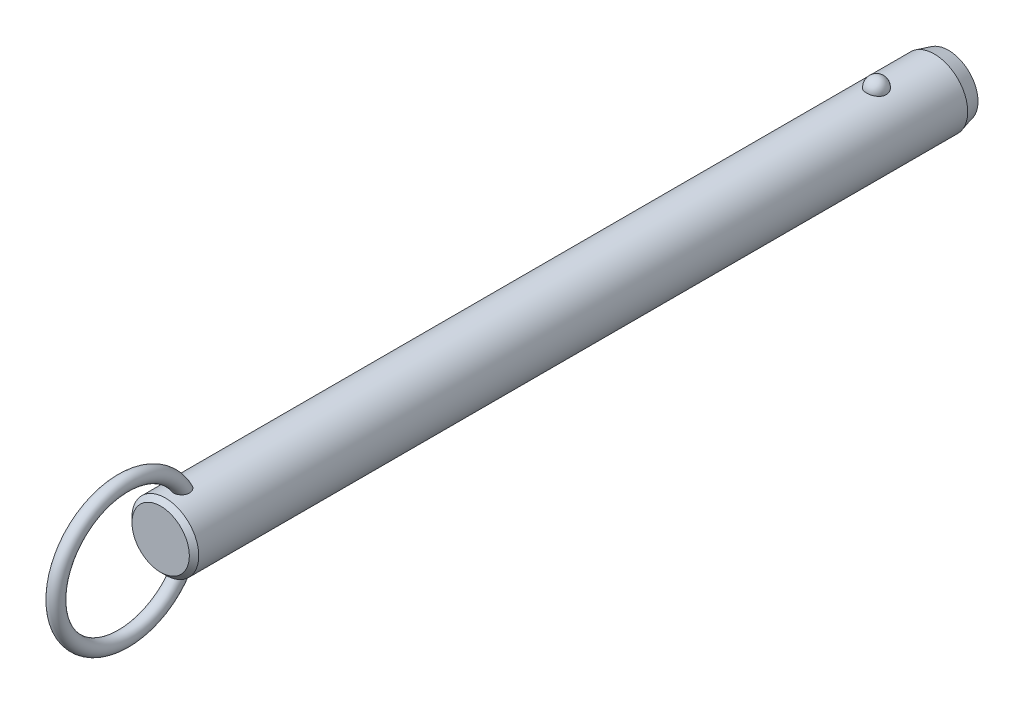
ISO-10303-21;
HEADER;
FILE_DESCRIPTION(('STEP AP214'),'2;1');
FILE_NAME('part.step','',(''),(''),'','','');
FILE_SCHEMA(('AUTOMOTIVE_DESIGN { 1 0 10303 214 1 1 1 1 }'));
ENDSEC;
DATA;
#1=APPLICATION_CONTEXT('core data for automotive mechanical design processes');
#2=APPLICATION_PROTOCOL_DEFINITION('international standard','automotive_design',2000,#1);
#3=PRODUCT_CONTEXT('',#1,'mechanical');
#4=PRODUCT('Part','Part','',(#3));
#5=PRODUCT_RELATED_PRODUCT_CATEGORY('part','',(#4));
#6=PRODUCT_DEFINITION_FORMATION('','',#4);
#7=PRODUCT_DEFINITION_CONTEXT('part definition',#1,'design');
#8=PRODUCT_DEFINITION('design','',#6,#7);
#9=PRODUCT_DEFINITION_SHAPE('','',#8);
#10=(LENGTH_UNIT() NAMED_UNIT(*) SI_UNIT(.MILLI.,.METRE.));
#11=(NAMED_UNIT(*) PLANE_ANGLE_UNIT() SI_UNIT($,.RADIAN.));
#12=(NAMED_UNIT(*) SI_UNIT($,.STERADIAN.) SOLID_ANGLE_UNIT());
#13=UNCERTAINTY_MEASURE_WITH_UNIT(LENGTH_MEASURE(1.E-05),#10,'distance_accuracy_value','');
#14=(GEOMETRIC_REPRESENTATION_CONTEXT(3) GLOBAL_UNCERTAINTY_ASSIGNED_CONTEXT((#13)) GLOBAL_UNIT_ASSIGNED_CONTEXT((#10,
#11,#12)) REPRESENTATION_CONTEXT('',''));
#15=CARTESIAN_POINT('',(0.,0.,0.));
#16=DIRECTION('',(0.,0.,1.));
#17=DIRECTION('',(1.,0.,0.));
#18=AXIS2_PLACEMENT_3D('',#15,#16,#17);
#19=CARTESIAN_POINT('',(0.,0.,142.2));
#20=DIRECTION('',(0.,0.,-1.));
#21=DIRECTION('',(-1.,0.,0.));
#22=AXIS2_PLACEMENT_3D('',#19,#20,#21);
#23=CYLINDRICAL_SURFACE('',#22,7.1);
#24=CARTESIAN_POINT('',(2.0769088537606,6.78943661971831,-2.1));
#25=CARTESIAN_POINT('',(2.07690739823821,6.78943796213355,-1.98268154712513));
#26=CARTESIAN_POINT('',(2.06738130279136,6.79237331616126,-1.86534506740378));
#27=CARTESIAN_POINT('',(2.0295040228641,6.8037853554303,-1.63400788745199));
#28=CARTESIAN_POINT('',(2.00114757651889,6.81226358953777,-1.52000812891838));
#29=CARTESIAN_POINT('',(1.92632025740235,6.83379798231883,-1.29863433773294));
#30=CARTESIAN_POINT('',(1.87985726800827,6.84685214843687,-1.19125744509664));
#31=CARTESIAN_POINT('',(1.76995205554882,6.87608091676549,-0.98604657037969));
#32=CARTESIAN_POINT('',(1.70650980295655,6.8922555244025,-0.88821260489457));
#33=CARTESIAN_POINT('',(1.5638119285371,6.92602930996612,-0.704242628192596));
#34=CARTESIAN_POINT('',(1.4844714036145,6.94363582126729,-0.618173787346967));
#35=CARTESIAN_POINT('',(1.31221746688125,6.97823658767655,-0.460740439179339));
#36=CARTESIAN_POINT('',(1.21930409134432,6.99523084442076,-0.389375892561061));
#37=CARTESIAN_POINT('',(1.02268781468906,7.02666176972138,-0.263547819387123));
#38=CARTESIAN_POINT('',(0.91902009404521,7.04110638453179,-0.209031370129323));
#39=CARTESIAN_POINT('',(0.703548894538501,7.06588726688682,-0.118163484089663));
#40=CARTESIAN_POINT('',(0.591746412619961,7.07622403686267,-0.0818098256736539));
#41=CARTESIAN_POINT('',(0.365557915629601,7.09147068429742,-0.0288711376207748));
#42=CARTESIAN_POINT('',(0.251267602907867,7.09648447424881,-0.0119070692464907));
#43=CARTESIAN_POINT('',(0.0213499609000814,7.10089837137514,0.00304925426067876));
#44=CARTESIAN_POINT('',(-0.0942772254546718,7.10029907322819,0.00104351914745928));
#45=CARTESIAN_POINT('',(-0.321651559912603,7.09360829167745,-0.0216931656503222));
#46=CARTESIAN_POINT('',(-0.433431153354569,7.08760388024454,-0.0421272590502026));
#47=CARTESIAN_POINT('',(-0.651862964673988,7.07086131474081,-0.100729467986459));
#48=CARTESIAN_POINT('',(-0.758515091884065,7.06012307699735,-0.138897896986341));
#49=CARTESIAN_POINT('',(-0.964449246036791,7.03496097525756,-0.232213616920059));
#50=CARTESIAN_POINT('',(-1.06368095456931,7.02051445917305,-0.287465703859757));
#51=CARTESIAN_POINT('',(-1.25145353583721,6.98948740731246,-0.413383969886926));
#52=CARTESIAN_POINT('',(-1.33999321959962,6.97290663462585,-0.48405186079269));
#53=CARTESIAN_POINT('',(-1.50591604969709,6.93898770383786,-0.640594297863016));
#54=CARTESIAN_POINT('',(-1.58302488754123,6.92164094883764,-0.726757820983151));
#55=CARTESIAN_POINT('',(-1.72189320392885,6.8884103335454,-0.91092752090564));
#56=CARTESIAN_POINT('',(-1.78365144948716,6.87252659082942,-1.008934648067));
#57=CARTESIAN_POINT('',(-1.89101272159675,6.84377189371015,-1.21549497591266));
#58=CARTESIAN_POINT('',(-1.93639553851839,6.83094274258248,-1.32416860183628));
#59=CARTESIAN_POINT('',(-2.00874275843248,6.81002070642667,-1.54791500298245));
#60=CARTESIAN_POINT('',(-2.03570774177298,6.80192767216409,-1.66298757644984));
#61=CARTESIAN_POINT('',(-2.07047276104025,6.7914266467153,-1.89571453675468));
#62=CARTESIAN_POINT('',(-2.07835878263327,6.78899315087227,-2.01335491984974));
#63=CARTESIAN_POINT('',(-2.07502083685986,6.79001409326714,-2.24833570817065));
#64=CARTESIAN_POINT('',(-2.06379746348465,6.7934683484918,-2.36567612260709));
#65=CARTESIAN_POINT('',(-2.02263913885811,6.80583442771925,-2.59603194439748));
#66=CARTESIAN_POINT('',(-1.99281127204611,6.81471501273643,-2.70906820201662));
#67=CARTESIAN_POINT('',(-1.91526639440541,6.83691232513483,-2.92836575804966));
#68=CARTESIAN_POINT('',(-1.8675486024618,6.85022924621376,-3.03462676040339));
#69=CARTESIAN_POINT('',(-1.75504492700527,6.87991336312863,-3.23806487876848));
#70=CARTESIAN_POINT('',(-1.69015924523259,6.89629822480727,-3.33518422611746));
#71=CARTESIAN_POINT('',(-1.54505404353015,6.93024852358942,-3.51697105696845));
#72=CARTESIAN_POINT('',(-1.46483385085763,6.94781401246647,-3.60163799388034));
#73=CARTESIAN_POINT('',(-1.29071406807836,6.98225977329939,-3.75654119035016));
#74=CARTESIAN_POINT('',(-1.19675650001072,6.99913673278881,-3.82671308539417));
#75=CARTESIAN_POINT('',(-0.997940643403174,7.03023618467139,-3.9501837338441));
#76=CARTESIAN_POINT('',(-0.89308318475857,7.04445887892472,-4.00348377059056));
#77=CARTESIAN_POINT('',(-0.676902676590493,7.06848365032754,-4.09107242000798));
#78=CARTESIAN_POINT('',(-0.565686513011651,7.0783430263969,-4.12560889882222));
#79=CARTESIAN_POINT('',(-0.338739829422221,7.09282534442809,-4.17575450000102));
#80=CARTESIAN_POINT('',(-0.223009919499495,7.09744899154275,-4.19136617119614));
#81=CARTESIAN_POINT('',(0.00707628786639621,7.10090930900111,-4.20307965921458));
#82=CARTESIAN_POINT('',(0.121410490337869,7.09986531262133,-4.19958377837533));
#83=CARTESIAN_POINT('',(0.347815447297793,7.092380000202,-4.17411564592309));
#84=CARTESIAN_POINT('',(0.459886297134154,7.08593891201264,-4.15214417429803));
#85=CARTESIAN_POINT('',(0.678084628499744,7.06838983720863,-4.09049562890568));
#86=CARTESIAN_POINT('',(0.784237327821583,7.05730369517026,-4.05090137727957));
#87=CARTESIAN_POINT('',(0.988305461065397,7.03163139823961,-3.95511447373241));
#88=CARTESIAN_POINT('',(1.08622031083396,7.01704499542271,-3.89892064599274));
#89=CARTESIAN_POINT('',(1.27284490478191,6.98562668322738,-3.77035541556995));
#90=CARTESIAN_POINT('',(1.36137372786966,6.96876135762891,-3.69772964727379));
#91=CARTESIAN_POINT('',(1.52509486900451,6.93477412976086,-3.53878279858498));
#92=CARTESIAN_POINT('',(1.60028496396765,6.91765218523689,-3.45245943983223));
#93=CARTESIAN_POINT('',(1.73681688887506,6.88465753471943,-3.26658774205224));
#94=CARTESIAN_POINT('',(1.79785966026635,6.86881574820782,-3.16681408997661));
#95=CARTESIAN_POINT('',(1.90265327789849,6.84053157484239,-2.95814408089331));
#96=CARTESIAN_POINT('',(1.94640861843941,6.82808830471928,-2.84925010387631));
#97=CARTESIAN_POINT('',(2.01274378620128,6.80881460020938,-2.63454318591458));
#98=CARTESIAN_POINT('',(2.03676193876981,6.80160856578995,-2.52920574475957));
#99=CARTESIAN_POINT('',(2.06884490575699,6.79191902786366,-2.3159172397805));
#100=CARTESIAN_POINT('',(2.07691019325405,6.78943538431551,-2.20796625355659));
#101=CARTESIAN_POINT('',(2.0769088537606,6.78943661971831,-2.1));
#102=B_SPLINE_CURVE_WITH_KNOTS('',3,(#24,#25,#26,#27,#28,#29,#30,#31,#32,#33,#34,#35,#36,#37,
#38,#39,#40,#41,#42,#43,#44,#45,#46,#47,#48,#49,#50,#51,#52,#53,#54,#55,#56,#57,#58,#59,#60,#61,
#62,#63,#64,#65,#66,#67,#68,#69,#70,#71,#72,#73,#74,#75,#76,#77,#78,#79,#80,#81,#82,#83,#84,#85,
#86,#87,#88,#89,#90,#91,#92,#93,#94,#95,#96,#97,#98,#99,#100,#101),.UNSPECIFIED.,.T.,.F.,(4,2,2,
2,2,2,2,2,2,2,2,2,2,2,2,2,2,2,2,2,2,2,2,2,2,2,2,2,2,2,2,2,2,2,2,2,2,2,4),(0.,0.351568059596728,
0.703234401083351,1.05474780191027,1.40626181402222,1.75970563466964,2.11314851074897,
2.4654696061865,2.81774759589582,3.16301449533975,3.50824481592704,3.84801136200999,
4.18778391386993,4.52968352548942,4.87162112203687,5.22076181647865,5.56993054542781,
5.92363364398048,6.27732559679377,6.62942052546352,6.98150450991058,7.33158042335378,
7.68167162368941,8.03384443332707,8.38603269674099,8.73975272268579,9.09344583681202,
9.44234545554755,9.79119807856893,10.1327344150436,10.4742563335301,10.8141898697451,
11.1541474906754,11.4997793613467,11.8454687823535,12.1979079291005,12.5502553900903,
12.8738073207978,13.1973496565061),.UNSPECIFIED.);
#103=CARTESIAN_POINT('',(2.0769088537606,6.78943661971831,-2.1));
#104=VERTEX_POINT('',#103);
#105=EDGE_CURVE('E41',#104,#104,#102,.T.);
#106=ORIENTED_EDGE('',*,*,#105,.T.);
#107=EDGE_LOOP('',(#106));
#108=FACE_BOUND('',#107,.T.);
#109=CARTESIAN_POINT('',(0.,0.,149.12));
#110=DIRECTION('',(0.,0.,1.));
#111=DIRECTION('',(1.,0.,0.));
#112=AXIS2_PLACEMENT_3D('',#109,#110,#111);
#113=CIRCLE('',#112,7.1);
#114=CARTESIAN_POINT('',(7.1,0.,149.12));
#115=VERTEX_POINT('',#114);
#116=EDGE_CURVE('E10',#115,#115,#113,.F.);
#117=ORIENTED_EDGE('',*,*,#116,.T.);
#118=EDGE_LOOP('',(#117));
#119=FACE_BOUND('',#118,.T.);
#120=CARTESIAN_POINT('',(-0.429539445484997,-7.08699541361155,143.942921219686));
#121=CARTESIAN_POINT('',(-0.508331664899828,-7.08221999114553,143.966876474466));
#122=CARTESIAN_POINT('',(-0.585039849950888,-7.07624016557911,143.997457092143));
#123=CARTESIAN_POINT('',(-0.73208265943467,-7.06254296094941,144.071024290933));
#124=CARTESIAN_POINT('',(-0.802417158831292,-7.05482554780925,144.114011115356));
#125=CARTESIAN_POINT('',(-0.934722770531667,-7.03851844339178,144.211113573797));
#126=CARTESIAN_POINT('',(-0.996700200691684,-7.02992941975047,144.265220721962));
#127=CARTESIAN_POINT('',(-1.11079942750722,-7.01280697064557,144.382967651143));
#128=CARTESIAN_POINT('',(-1.16292136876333,-7.00427354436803,144.446607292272));
#129=CARTESIAN_POINT('',(-1.25705660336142,-6.98799959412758,144.582687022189));
#130=CARTESIAN_POINT('',(-1.29888032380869,-6.98027525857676,144.655259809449));
#131=CARTESIAN_POINT('',(-1.37069920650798,-6.96652886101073,144.806168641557));
#132=CARTESIAN_POINT('',(-1.40069157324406,-6.96050720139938,144.884506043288));
#133=CARTESIAN_POINT('',(-1.45043507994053,-6.95031881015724,145.050190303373));
#134=CARTESIAN_POINT('',(-1.46937115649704,-6.94630231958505,145.137789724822));
#135=CARTESIAN_POINT('',(-1.49424917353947,-6.94099239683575,145.314871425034));
#136=CARTESIAN_POINT('',(-1.50018601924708,-6.93970003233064,145.404354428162));
#137=CARTESIAN_POINT('',(-1.49978214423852,-6.93978815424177,145.594060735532));
#138=CARTESIAN_POINT('',(-1.49187639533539,-6.94150934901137,145.694279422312));
#139=CARTESIAN_POINT('',(-1.46177925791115,-6.94790814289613,145.892479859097));
#140=CARTESIAN_POINT('',(-1.43957541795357,-6.95258831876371,145.990459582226));
#141=CARTESIAN_POINT('',(-1.37783293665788,-6.96510647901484,146.19536292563));
#142=CARTESIAN_POINT('',(-1.33634073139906,-6.97328848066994,146.301680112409));
#143=CARTESIAN_POINT('',(-1.23686994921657,-6.99161706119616,146.506177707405));
#144=CARTESIAN_POINT('',(-1.17889192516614,-7.00176357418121,146.604358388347));
#145=CARTESIAN_POINT('',(-1.0587512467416,-7.02082898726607,146.772374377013));
#146=CARTESIAN_POINT('',(-0.999247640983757,-7.02963746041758,146.844123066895));
#147=CARTESIAN_POINT('',(-0.869494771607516,-7.04686074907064,146.977195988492));
#148=CARTESIAN_POINT('',(-0.799263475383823,-7.05527619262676,147.038537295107));
#149=CARTESIAN_POINT('',(-0.665408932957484,-7.06899457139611,147.135131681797));
#150=CARTESIAN_POINT('',(-0.603817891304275,-7.07457275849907,147.173151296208));
#151=CARTESIAN_POINT('',(-0.475172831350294,-7.08437420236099,147.238758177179));
#152=CARTESIAN_POINT('',(-0.408123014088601,-7.08859848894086,147.266353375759));
#153=CARTESIAN_POINT('',(-0.269431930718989,-7.09522749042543,147.309256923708));
#154=CARTESIAN_POINT('',(-0.197757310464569,-7.09761688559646,147.324461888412));
#155=CARTESIAN_POINT('',(-0.0527849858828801,-7.10017268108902,147.340716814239));
#156=CARTESIAN_POINT('',(0.020511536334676,-7.10034065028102,147.341776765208));
#157=CARTESIAN_POINT('',(0.156426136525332,-7.09855986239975,147.330461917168));
#158=CARTESIAN_POINT('',(0.219199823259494,-7.09688191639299,147.319806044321));
#159=CARTESIAN_POINT('',(0.342134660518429,-7.09201880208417,147.288537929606));
#160=CARTESIAN_POINT('',(0.402295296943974,-7.08883333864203,147.267923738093));
#161=CARTESIAN_POINT('',(0.520687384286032,-7.08113868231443,147.217212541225));
#162=CARTESIAN_POINT('',(0.578791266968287,-7.07658958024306,147.186827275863));
#163=CARTESIAN_POINT('',(0.69017323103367,-7.06659708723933,147.118367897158));
#164=CARTESIAN_POINT('',(0.743447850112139,-7.061153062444,147.080288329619));
#165=CARTESIAN_POINT('',(0.87094790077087,-7.04680292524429,146.976592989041));
#166=CARTESIAN_POINT('',(0.941828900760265,-7.03755800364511,146.906897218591));
#167=CARTESIAN_POINT('',(1.07136606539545,-7.01900793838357,146.756945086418));
#168=CARTESIAN_POINT('',(1.13000013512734,-7.00970271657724,146.676670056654));
#169=CARTESIAN_POINT('',(1.23579584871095,-6.99183327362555,146.506899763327));
#170=CARTESIAN_POINT('',(1.28274271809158,-6.98328455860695,146.417269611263));
#171=CARTESIAN_POINT('',(1.3635144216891,-6.96796352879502,146.232176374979));
#172=CARTESIAN_POINT('',(1.39733971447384,-6.96119115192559,146.136713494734));
#173=CARTESIAN_POINT('',(1.45579181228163,-6.94922464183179,145.92530928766));
#174=CARTESIAN_POINT('',(1.47790145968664,-6.94449000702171,145.808631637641));
#175=CARTESIAN_POINT('',(1.50168752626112,-6.93938731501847,145.573015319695));
#176=CARTESIAN_POINT('',(1.50336085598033,-6.93901991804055,145.45407631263));
#177=CARTESIAN_POINT('',(1.48486516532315,-6.9430010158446,145.22360799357));
#178=CARTESIAN_POINT('',(1.46573441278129,-6.9471253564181,145.111995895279));
#179=CARTESIAN_POINT('',(1.40606892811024,-6.95944667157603,144.894886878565));
#180=CARTESIAN_POINT('',(1.36556446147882,-6.96763788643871,144.7893815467));
#181=CARTESIAN_POINT('',(1.2708270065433,-6.98548038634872,144.604287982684));
#182=CARTESIAN_POINT('',(1.21949810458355,-6.99473841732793,144.523171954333));
#183=CARTESIAN_POINT('',(1.10242050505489,-7.0141406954,144.372227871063));
#184=CARTESIAN_POINT('',(1.03668119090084,-7.02428436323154,144.30239252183));
#185=CARTESIAN_POINT('',(0.900559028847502,-7.04295285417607,144.183573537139));
#186=CARTESIAN_POINT('',(0.831428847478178,-7.05153466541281,144.133157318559));
#187=CARTESIAN_POINT('',(0.685291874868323,-7.06723150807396,144.045142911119));
#188=CARTESIAN_POINT('',(0.608287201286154,-7.07434693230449,144.007541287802));
#189=CARTESIAN_POINT('',(0.451878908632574,-7.08602232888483,143.947491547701));
#190=CARTESIAN_POINT('',(0.372686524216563,-7.09067127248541,143.924508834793));
#191=CARTESIAN_POINT('',(0.211477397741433,-7.09730788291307,143.892035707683));
#192=CARTESIAN_POINT('',(0.129460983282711,-7.09929585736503,143.88254373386));
#193=CARTESIAN_POINT('',(-0.0332905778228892,-7.10037858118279,143.877351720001));
#194=CARTESIAN_POINT('',(-0.114016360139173,-7.09953334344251,143.881365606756));
#195=CARTESIAN_POINT('',(-0.27367033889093,-7.09517338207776,143.902454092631));
#196=CARTESIAN_POINT('',(-0.352598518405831,-7.09165863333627,143.919528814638));
#197=CARTESIAN_POINT('',(-0.429539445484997,-7.08699541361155,143.942921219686));
#198=B_SPLINE_CURVE_WITH_KNOTS('',3,(#120,#121,#122,#123,#124,#125,#126,#127,#128,#129,#130,
#131,#132,#133,#134,#135,#136,#137,#138,#139,#140,#141,#142,#143,#144,#145,#146,#147,#148,#149,
#150,#151,#152,#153,#154,#155,#156,#157,#158,#159,#160,#161,#162,#163,#164,#165,#166,#167,#168,
#169,#170,#171,#172,#173,#174,#175,#176,#177,#178,#179,#180,#181,#182,#183,#184,#185,#186,#187,
#188,#189,#190,#191,#192,#193,#194,#195,#196,#197),.UNSPECIFIED.,.T.,.F.,(4,2,2,2,2,2,2,2,2,2,2,
2,2,2,2,2,2,2,2,2,2,2,2,2,2,2,2,2,2,2,2,2,2,2,2,2,2,2,4),(0.,0.247183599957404,
0.494372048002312,0.741372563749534,0.988369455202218,1.23962059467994,1.490931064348,
1.75897818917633,2.02713035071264,2.3275826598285,2.62829697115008,2.97008736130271,
3.31186629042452,3.59175319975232,3.87117637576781,4.08813841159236,4.30493502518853,
4.5235225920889,4.74195577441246,4.93215328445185,5.12238804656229,5.318848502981,
5.51544871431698,5.81332317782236,6.11173048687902,6.41527266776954,6.71880423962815,
7.07358156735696,7.42841252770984,7.76631485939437,8.10373999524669,8.39142246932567,
8.67891817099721,8.93560332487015,9.19221962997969,9.43881106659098,9.68537399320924,
9.92674752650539,10.1681233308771),.UNSPECIFIED.);
#199=CARTESIAN_POINT('',(-0.429539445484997,-7.08699541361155,143.942921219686));
#200=VERTEX_POINT('',#199);
#201=EDGE_CURVE('E59',#200,#200,#198,.T.);
#202=ORIENTED_EDGE('',*,*,#201,.T.);
#203=EDGE_LOOP('',(#202));
#204=FACE_BOUND('',#203,.T.);
#205=CARTESIAN_POINT('',(-0.429539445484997,7.08699541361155,143.942921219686));
#206=CARTESIAN_POINT('',(-0.351665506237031,7.09171429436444,143.919246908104));
#207=CARTESIAN_POINT('',(-0.271733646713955,7.09525896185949,143.902036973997));
#208=CARTESIAN_POINT('',(-0.110026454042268,7.09960839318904,143.881005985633));
#209=CARTESIAN_POINT('',(-0.0282502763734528,7.10041187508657,143.877191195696));
#210=CARTESIAN_POINT('',(0.134782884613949,7.09918849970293,143.883059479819));
#211=CARTESIAN_POINT('',(0.216039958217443,7.09716214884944,143.89274013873));
#212=CARTESIAN_POINT('',(0.375730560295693,7.09050177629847,143.925347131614));
#213=CARTESIAN_POINT('',(0.454164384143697,7.08586802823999,143.948272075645));
#214=CARTESIAN_POINT('',(0.606025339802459,7.07449911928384,144.006771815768));
#215=CARTESIAN_POINT('',(0.679451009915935,7.06776334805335,144.042350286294));
#216=CARTESIAN_POINT('',(0.81923414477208,7.05292866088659,144.125175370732));
#217=CARTESIAN_POINT('',(0.885591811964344,7.04482978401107,144.172421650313));
#218=CARTESIAN_POINT('',(1.00993211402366,7.02808709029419,144.277590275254));
#219=CARTESIAN_POINT('',(1.06785399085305,7.01943990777,144.335583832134));
#220=CARTESIAN_POINT('',(1.17342527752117,7.00256662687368,144.460301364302));
#221=CARTESIAN_POINT('',(1.22107408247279,6.99434055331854,144.527025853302));
#222=CARTESIAN_POINT('',(1.30652927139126,6.97889183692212,144.669362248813));
#223=CARTESIAN_POINT('',(1.34399711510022,6.97170674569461,144.745180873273));
#224=CARTESIAN_POINT('',(1.40682616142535,6.95930080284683,144.901810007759));
#225=CARTESIAN_POINT('',(1.43218374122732,6.95408053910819,144.98262200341));
#226=CARTESIAN_POINT('',(1.47246409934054,6.94566853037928,145.153531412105));
#227=CARTESIAN_POINT('',(1.48642590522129,6.9426653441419,145.24386307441));
#228=CARTESIAN_POINT('',(1.5011410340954,6.93949744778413,145.425619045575));
#229=CARTESIAN_POINT('',(1.50188917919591,6.93933385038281,145.517043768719));
#230=CARTESIAN_POINT('',(1.49030464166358,6.94183245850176,145.71084381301));
#231=CARTESIAN_POINT('',(1.47627413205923,6.94486147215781,145.813112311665));
#232=CARTESIAN_POINT('',(1.43356351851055,6.95380194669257,146.014471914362));
#233=CARTESIAN_POINT('',(1.4048676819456,6.95971650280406,146.113559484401));
#234=CARTESIAN_POINT('',(1.32908750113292,6.97461208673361,146.318908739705));
#235=CARTESIAN_POINT('',(1.28011435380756,6.98388945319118,146.424456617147));
#236=CARTESIAN_POINT('',(1.16520357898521,7.00397743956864,146.625760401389));
#237=CARTESIAN_POINT('',(1.09927694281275,7.01478706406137,146.721522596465));
#238=CARTESIAN_POINT('',(0.969361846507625,7.03373936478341,146.876756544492));
#239=CARTESIAN_POINT('',(0.909042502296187,7.04187023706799,146.939303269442));
#240=CARTESIAN_POINT('',(0.779178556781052,7.05741732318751,147.054053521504));
#241=CARTESIAN_POINT('',(0.709649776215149,7.06483472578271,147.106274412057));
#242=CARTESIAN_POINT('',(0.576854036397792,7.0767751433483,147.188113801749));
#243=CARTESIAN_POINT('',(0.515118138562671,7.08158033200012,147.220164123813));
#244=CARTESIAN_POINT('',(0.387127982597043,7.08972701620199,147.273765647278));
#245=CARTESIAN_POINT('',(0.320877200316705,7.09306962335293,147.295324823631));
#246=CARTESIAN_POINT('',(0.185041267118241,7.09791507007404,147.326400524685));
#247=CARTESIAN_POINT('',(0.115437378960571,7.09940591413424,147.335838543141));
#248=CARTESIAN_POINT('',(-0.024315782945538,7.10030171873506,147.341522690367));
#249=CARTESIAN_POINT('',(-0.0944648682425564,7.0997073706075,147.337773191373));
#250=CARTESIAN_POINT('',(-0.225713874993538,7.09668414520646,147.318508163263));
#251=CARTESIAN_POINT('',(-0.287006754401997,7.09444865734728,147.304232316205));
#252=CARTESIAN_POINT('',(-0.406555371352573,7.08860360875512,147.266368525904));
#253=CARTESIAN_POINT('',(-0.464809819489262,7.08499346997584,147.242776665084));
#254=CARTESIAN_POINT('',(-0.594955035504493,7.07541654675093,147.178923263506));
#255=CARTESIAN_POINT('',(-0.665389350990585,7.06906574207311,147.135753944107));
#256=CARTESIAN_POINT('',(-0.798242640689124,7.05530261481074,147.038587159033));
#257=CARTESIAN_POINT('',(-0.860645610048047,7.0478882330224,146.984568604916));
#258=CARTESIAN_POINT('',(-0.994249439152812,7.03045217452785,146.850996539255));
#259=CARTESIAN_POINT('',(-1.06260129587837,7.02030745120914,146.768614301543));
#260=CARTESIAN_POINT('',(-1.18502045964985,7.00068382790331,146.593843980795));
#261=CARTESIAN_POINT('',(-1.23907684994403,6.99120544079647,146.501448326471));
#262=CARTESIAN_POINT('',(-1.33335589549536,6.97384343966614,146.308008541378));
#263=CARTESIAN_POINT('',(-1.37336138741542,6.96598557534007,146.206856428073));
#264=CARTESIAN_POINT('',(-1.43770677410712,6.95299053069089,145.999504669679));
#265=CARTESIAN_POINT('',(-1.46204473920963,6.94785368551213,145.89330440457));
#266=CARTESIAN_POINT('',(-1.49537533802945,6.94076296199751,145.668231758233));
#267=CARTESIAN_POINT('',(-1.50273564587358,6.93914842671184,145.54909751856));
#268=CARTESIAN_POINT('',(-1.4954555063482,6.94072368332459,145.311470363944));
#269=CARTESIAN_POINT('',(-1.48082914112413,6.94391040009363,145.192977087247));
#270=CARTESIAN_POINT('',(-1.43076401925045,6.95438579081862,144.973432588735));
#271=CARTESIAN_POINT('',(-1.39762227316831,6.96121852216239,144.871841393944));
#272=CARTESIAN_POINT('',(-1.31211274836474,6.97783941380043,144.677351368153));
#273=CARTESIAN_POINT('',(-1.25976607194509,6.98762432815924,144.58444313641));
#274=CARTESIAN_POINT('',(-1.14583073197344,7.00713153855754,144.424160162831));
#275=CARTESIAN_POINT('',(-1.08665947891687,7.01665982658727,144.355035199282));
#276=CARTESIAN_POINT('',(-0.956606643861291,7.03556646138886,144.228878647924));
#277=CARTESIAN_POINT('',(-0.885737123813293,7.04494495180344,144.171834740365));
#278=CARTESIAN_POINT('',(-0.7515580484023,7.06035735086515,144.083100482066));
#279=CARTESIAN_POINT('',(-0.690120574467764,7.0666695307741,144.048593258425));
#280=CARTESIAN_POINT('',(-0.562815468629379,7.07794609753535,143.988750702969));
#281=CARTESIAN_POINT('',(-0.496948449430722,7.08291067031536,143.963414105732));
#282=CARTESIAN_POINT('',(-0.429539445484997,7.08699541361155,143.942921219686));
#283=B_SPLINE_CURVE_WITH_KNOTS('',3,(#205,#206,#207,#208,#209,#210,#211,#212,#213,#214,#215,
#216,#217,#218,#219,#220,#221,#222,#223,#224,#225,#226,#227,#228,#229,#230,#231,#232,#233,#234,
#235,#236,#237,#238,#239,#240,#241,#242,#243,#244,#245,#246,#247,#248,#249,#250,#251,#252,#253,
#254,#255,#256,#257,#258,#259,#260,#261,#262,#263,#264,#265,#266,#267,#268,#269,#270,#271,#272,
#273,#274,#275,#276,#277,#278,#279,#280,#281,#282),.UNSPECIFIED.,.T.,.F.,(4,2,2,2,2,2,2,2,2,2,2,
2,2,2,2,2,2,2,2,2,2,2,2,2,2,2,2,2,2,2,2,2,2,2,2,2,2,2,4),(0.,0.244335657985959,
0.488785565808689,0.733191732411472,0.977572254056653,1.22202379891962,1.46646834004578,
1.71259457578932,1.9587352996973,2.21226768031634,2.46587585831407,2.73913816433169,
3.01250754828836,3.32109936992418,3.63002293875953,3.9786351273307,4.32702187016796,
4.58793945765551,4.84841449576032,5.05676704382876,5.26496096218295,5.47449661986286,
5.68396281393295,5.87205447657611,6.06022532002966,6.30743751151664,6.55513496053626,
6.87602468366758,7.19715875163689,7.5230577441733,7.84899686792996,8.20516155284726,
8.56109821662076,8.88040084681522,9.19935367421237,9.47236282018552,9.74509220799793,
9.95662250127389,10.1681235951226),.UNSPECIFIED.);
#284=CARTESIAN_POINT('',(-0.429539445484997,7.08699541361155,143.942921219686));
#285=VERTEX_POINT('',#284);
#286=EDGE_CURVE('E67',#285,#285,#283,.T.);
#287=ORIENTED_EDGE('',*,*,#286,.T.);
#288=EDGE_LOOP('',(#287));
#289=FACE_BOUND('',#288,.T.);
#290=CARTESIAN_POINT('',(0.,0.,-14.3999999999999));
#291=DIRECTION('',(0.,0.,-1.));
#292=DIRECTION('',(-1.,0.,0.));
#293=AXIS2_PLACEMENT_3D('',#290,#291,#292);
#294=CIRCLE('',#293,7.1);
#295=CARTESIAN_POINT('',(-7.1,0.,-14.3999999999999));
#296=VERTEX_POINT('',#295);
#297=EDGE_CURVE('E56',#296,#296,#294,.F.);
#298=ORIENTED_EDGE('',*,*,#297,.T.);
#299=EDGE_LOOP('',(#298));
#300=FACE_BOUND('',#299,.T.);
#301=ADVANCED_FACE('F37',(#108,#119,#204,#289,#300),#23,.T.);
#302=CARTESIAN_POINT('',(0.,0.,-17.4));
#303=DIRECTION('',(0.,0.,-1.));
#304=DIRECTION('',(-1.,0.,0.));
#305=AXIS2_PLACEMENT_3D('',#302,#303,#304);
#306=PLANE('',#305);
#307=CARTESIAN_POINT('',(0.,0.,-17.4));
#308=DIRECTION('',(0.,0.,-1.));
#309=DIRECTION('',(-1.,0.,0.));
#310=AXIS2_PLACEMENT_3D('',#307,#308,#309);
#311=CIRCLE('',#310,6.29615242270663);
#312=CARTESIAN_POINT('',(-6.29615242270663,0.,-17.4));
#313=VERTEX_POINT('',#312);
#314=EDGE_CURVE('E66',#313,#313,#311,.T.);
#315=ORIENTED_EDGE('',*,*,#314,.T.);
#316=EDGE_LOOP('',(#315));
#317=FACE_BOUND('',#316,.T.);
#318=ADVANCED_FACE('F85',(#317),#306,.T.);
#319=CARTESIAN_POINT('',(0.,0.,-17.4));
#320=DIRECTION('',(0.,0.,1.));
#321=DIRECTION('',(1.,0.,0.));
#322=AXIS2_PLACEMENT_3D('',#319,#320,#321);
#323=CONICAL_SURFACE('',#322,6.29615242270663,0.261799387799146);
#324=ORIENTED_EDGE('',*,*,#297,.F.);
#325=EDGE_LOOP('',(#324));
#326=FACE_BOUND('',#325,.T.);
#327=ORIENTED_EDGE('',*,*,#314,.F.);
#328=EDGE_LOOP('',(#327));
#329=FACE_BOUND('',#328,.T.);
#330=ADVANCED_FACE('F83',(#326,#329),#323,.T.);
#331=CARTESIAN_POINT('',(0.,0.,150.12));
#332=DIRECTION('',(0.,0.,1.));
#333=DIRECTION('',(1.,0.,0.));
#334=AXIS2_PLACEMENT_3D('',#331,#332,#333);
#335=PLANE('',#334);
#336=CARTESIAN_POINT('',(0.,0.,150.12));
#337=DIRECTION('',(0.,0.,1.));
#338=DIRECTION('',(1.,0.,0.));
#339=AXIS2_PLACEMENT_3D('',#336,#337,#338);
#340=CIRCLE('',#339,6.10000000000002);
#341=CARTESIAN_POINT('',(6.10000000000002,0.,150.12));
#342=VERTEX_POINT('',#341);
#343=EDGE_CURVE('E50',#342,#342,#340,.T.);
#344=ORIENTED_EDGE('',*,*,#343,.T.);
#345=EDGE_LOOP('',(#344));
#346=FACE_BOUND('',#345,.T.);
#347=ADVANCED_FACE('F77',(#346),#335,.T.);
#348=CARTESIAN_POINT('',(0.,0.,158.05));
#349=DIRECTION('',(1.,0.,0.));
#350=DIRECTION('',(0.,0.,-1.));
#351=AXIS2_PLACEMENT_3D('',#348,#349,#350);
#352=TOROIDAL_SURFACE('',#351,14.35,1.5);
#353=ORIENTED_EDGE('',*,*,#286,.F.);
#354=EDGE_LOOP('',(#353));
#355=FACE_BOUND('',#354,.T.);
#356=ORIENTED_EDGE('',*,*,#201,.F.);
#357=EDGE_LOOP('',(#356));
#358=FACE_BOUND('',#357,.T.);
#359=ADVANCED_FACE('F73',(#355,#358),#352,.T.);
#360=CARTESIAN_POINT('',(0.,0.,150.12));
#361=DIRECTION('',(0.,0.,-1.));
#362=DIRECTION('',(-1.,0.,0.));
#363=AXIS2_PLACEMENT_3D('',#360,#361,#362);
#364=CONICAL_SURFACE('',#363,6.10000000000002,0.78539816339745);
#365=ORIENTED_EDGE('',*,*,#116,.F.);
#366=EDGE_LOOP('',(#365));
#367=FACE_BOUND('',#366,.T.);
#368=ORIENTED_EDGE('',*,*,#343,.F.);
#369=EDGE_LOOP('',(#368));
#370=FACE_BOUND('',#369,.T.);
#371=ADVANCED_FACE('F39',(#367,#370),#364,.T.);
#372=CARTESIAN_POINT('',(0.,7.1,-2.1));
#373=DIRECTION('',(0.,1.,0.));
#374=DIRECTION('',(0.,0.,1.));
#375=AXIS2_PLACEMENT_3D('',#372,#373,#374);
#376=SPHERICAL_SURFACE('',#375,2.10000000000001);
#377=ORIENTED_EDGE('',*,*,#105,.F.);
#378=EDGE_LOOP('',(#377));
#379=FACE_BOUND('',#378,.T.);
#380=ADVANCED_FACE('F79',(#379),#376,.T.);
#381=CLOSED_SHELL('',(#301,#318,#330,#347,#359,#371,#380));
#382=MANIFOLD_SOLID_BREP('B2',#381);
#383=ADVANCED_BREP_SHAPE_REPRESENTATION('',(#18,#382),#14);
#384=SHAPE_DEFINITION_REPRESENTATION(#9,#383);
ENDSEC;
END-ISO-10303-21;
